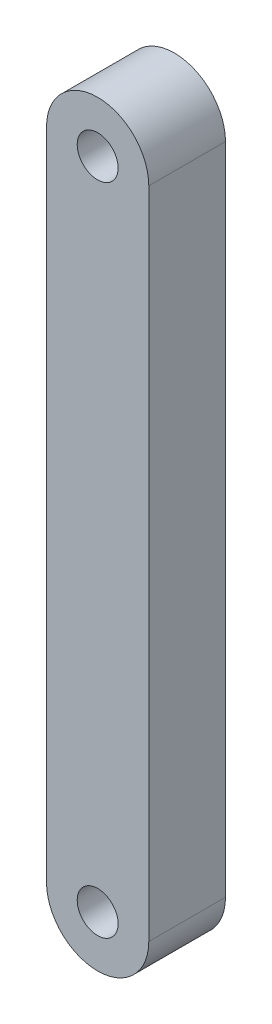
from build123d import *

# Parameters (mm, degrees)
SKETCH1_R           = 2.54
BOSS_EXTRUDE1_DEPTH = 9.525


with BuildPart() as part:
    # Sketch1 → Boss-Extrude1 (new body)
    with BuildSketch(Plane.XY):
        with BuildLine():
            Line((-6.35, -40.64), (-6.35, 40.64))
            ThreePointArc((-6.35, 40.64), (0, 46.99), (6.35, 40.64))
            Line((6.35, 40.64), (6.35, -40.64))
            ThreePointArc((6.35, -40.64), (0, -46.99), (-6.35, -40.64))
        make_face()
        with Locations(Location((0, 40.64, 0), (0, 0, 180))):
            Circle(SKETCH1_R, mode=Mode.SUBTRACT)
        with Locations(Location((0, -40.64, 0), (0, 0, 180))):
            Circle(SKETCH1_R, mode=Mode.SUBTRACT)
    extrude(amount=BOSS_EXTRUDE1_DEPTH)


solid = part.part
